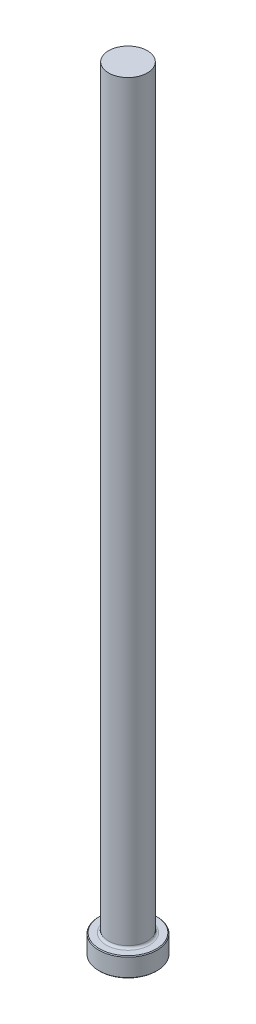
from build123d import *

# Parameters (mm, degrees)
CHAMFER1_SIZE = 0.254
FILLET1_R     = 0.762


with BuildPart() as part:
    # Sketch1 → Revolve1 (revolve)
    with BuildSketch(Plane.XY, mode=Mode.PRIVATE) as revolve1_sk:
        Polygon((0, 0), (-9.525, 0), (-9.525, 6.35), (-6.35, 6.35), (-6.35, 254), (0, 254), align=None)
    revolve(revolve1_sk.sketch.rotate(Axis((0, 259.958771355, 0), (0, -1, 0)), 270), axis=Axis((0, 259.958771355, 0), (0, -1, 0)))

    # Chamfer1
    chamfer1_edges = [part.edges().sort_by_distance(p)[0] for p in [
        (0, 6.35, -9.525),
        (0, 0, -9.525),
    ]]
    chamfer(chamfer1_edges, length=CHAMFER1_SIZE)

    # Fillet1
    fillet1_edges = [part.edges().sort_by_distance(p)[0] for p in [
        (0, 6.35, -6.35),
    ]]
    fillet(fillet1_edges, radius=FILLET1_R)


solid = part.part
